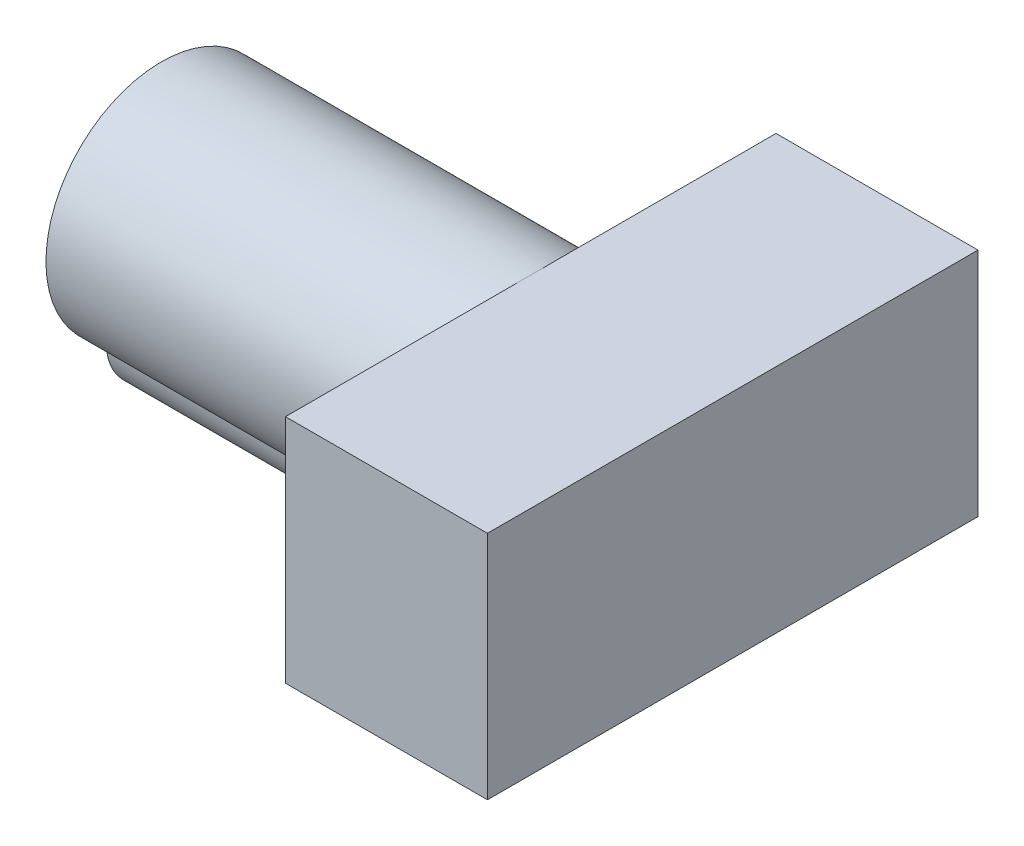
from build123d import *

# Parameters (mm, degrees)
SKETCH1_W                = 44.45
SKETCH1_H                = 107.95
BOSS_EXTRUDE1_DEPTH      = 50.8
SKETCH4_R                = 25.4
BOSS_EXTRUDE2_DEPTH      = 81.28
BOSS_EXTRUDE3_DEPTH      = 12.7
BOSS_EXTRUDE3_DEPTH_BACK = 12.7
SKETCH5_W                = 50.8
SKETCH5_H                = 25.4
CUT_EXTRUDE1_DEPTH       = 55.88


with BuildPart() as part:
    # Sketch1 → Boss-Extrude1 (new body)
    with BuildSketch(Plane(origin=(0, 0, 0), x_dir=(1, 0, 0), z_dir=(0, 1, 0))):
        with Locations((22.225, 53.975)):
            Rectangle(SKETCH1_W, SKETCH1_H)
    extrude(amount=BOSS_EXTRUDE1_DEPTH)

    # Sketch4 → Boss-Extrude2 (add)
    with BuildSketch(Plane.ZY):
        with Locations(Location((-53.975, 25.4, 0), (0, 0, 270))):
            Circle(SKETCH4_R)
    extrude(amount=BOSS_EXTRUDE2_DEPTH)

    # Sketch5 → Boss-Extrude3 (add, two sides: drawn at the far end of the back side and taken through both)
    with BuildSketch(Plane(origin=(0, 0, 0), x_dir=(-1, 0, 0), z_dir=(0, -1, 0)).offset(-BOSS_EXTRUDE3_DEPTH_BACK)):
        with Locations((55.88, 54.521492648)):
            Rectangle(SKETCH5_W, SKETCH5_H)
    extrude(amount=BOSS_EXTRUDE3_DEPTH + BOSS_EXTRUDE3_DEPTH_BACK)

    # Sketch6 → Cut-Extrude1 (cut)
    with BuildSketch(Plane.ZY.offset(81.28)):
        with BuildLine():
            ThreePointArc((-41.821492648, 3.096362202), (-54.521492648, -9.291912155), (-67.221492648, 3.096362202))
            Line((-67.221492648, 3.096362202), (-67.221492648, -12.7))
            Line((-67.221492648, -12.7), (-41.821492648, -12.7))
            Line((-41.821492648, -12.7), (-41.821492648, 3.096362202))
        make_face()
    extrude(amount=-CUT_EXTRUDE1_DEPTH, mode=Mode.SUBTRACT)


solid = part.part
